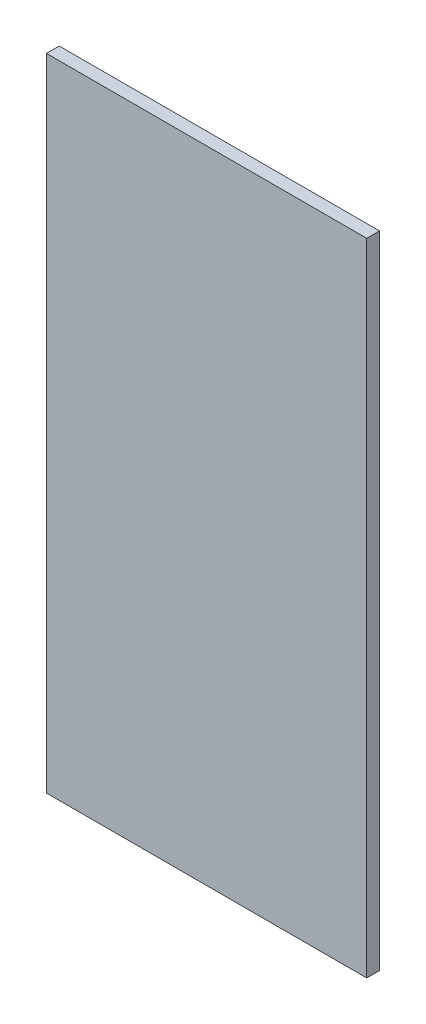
from build123d import *

# Parameters (mm, degrees)
SKIZZE2_W               = 500
SKIZZE2_H               = 1000
LINEAR_AUSTRAGEN1_DEPTH = 20


with BuildPart() as part:
    # Skizze2 → Linear austragen1 (new body)
    with BuildSketch(Plane.XY):
        with Locations((250, 500)):
            Rectangle(SKIZZE2_W, SKIZZE2_H)
    extrude(amount=-LINEAR_AUSTRAGEN1_DEPTH)


solid = part.part
